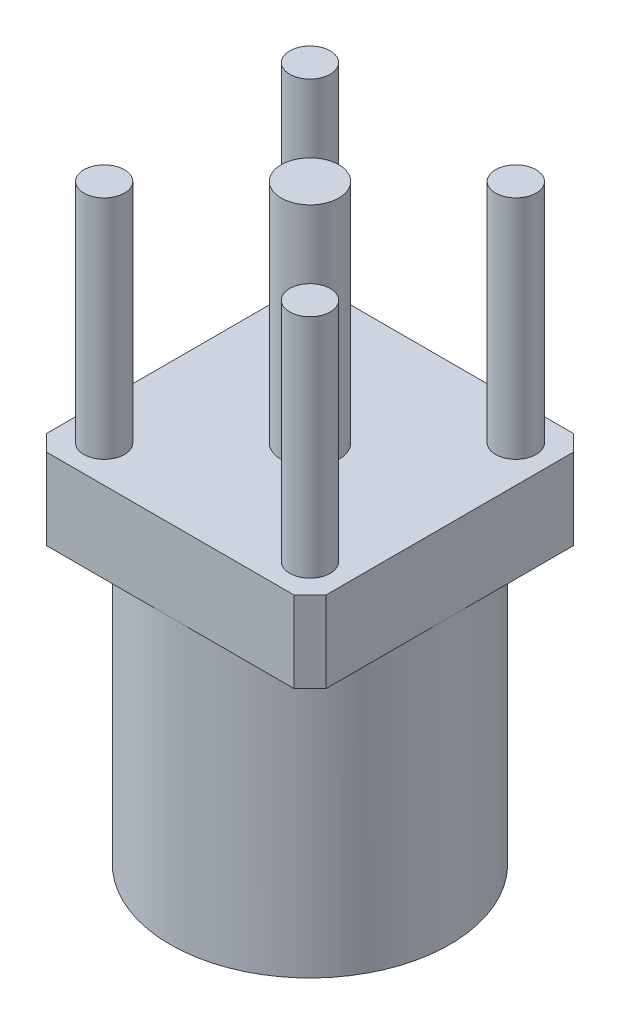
from build123d import *

# Parameters (mm, degrees)
BOSS_EXTRUDE1_DEPTH = 1
SKETCH4_R           = 1.725
SKETCH4_R_2         = 1.375
SKETCH4_R_3         = 0.35
BOSS_EXTRUDE2_DEPTH = 3.5
SKETCH5_R           = 0.25
SKETCH5_R_2         = 0.3556
BOSS_EXTRUDE3_DEPTH = 2.794
CUT_EXTRUDE1_START  = -1.016
SKETCH6_R           = 0.35
CUT_EXTRUDE1_DEPTH  = 1.016


with BuildPart() as part:
    # Sketch3 → Boss-Extrude1 (new body)
    with BuildSketch(Plane(origin=(0, 0, 0), x_dir=(1, 0, 0), z_dir=(0, 1, 0))):
        Polygon((-1.725, -1.525), (-1.525, -1.725), (1.525, -1.725), (1.725, -1.525), (1.725, 1.525), (1.525, 1.725), (-1.525, 1.725), (-1.725, 1.525), align=None)
    extrude(amount=BOSS_EXTRUDE1_DEPTH)

    # Sketch4 → Boss-Extrude2 (add)
    # profile 1 of 2: a face of its own
    with BuildSketch(Plane.XZ):
        with Locations(Location((0, 0, 0), (0, 0, 270))):
            Circle(SKETCH4_R)
        with Locations(Location((0, 0, 0), (0, 0, 270))):
            Circle(SKETCH4_R_2, mode=Mode.SUBTRACT)
    # profile 2 of 2: a face of its own
    with BuildSketch(Plane.XZ):
        with Locations(Location((0, 0, 0), (0, 0, 90))):
            Circle(SKETCH4_R_3)
    extrude(amount=BOSS_EXTRUDE2_DEPTH)

    # Sketch5 → Boss-Extrude3 (add)
    with BuildSketch(Plane(origin=(0, 1, 0), x_dir=(1, 0, 0), z_dir=(0, 1, 0))):
        with Locations(Location((-1.27, 1.27, 0), (0, 0, 270))):
            Circle(SKETCH5_R)
        with Locations(Location((-1.27, -1.27, 0), (0, 0, 270))):
            Circle(SKETCH5_R)
        with Locations(Location((1.27, 1.27, 0), (0, 0, 270))):
            Circle(SKETCH5_R)
        with Locations(Location((1.27, -1.27, 0), (0, 0, 270))):
            Circle(SKETCH5_R)
        with Locations(Location((0, 0, 0), (0, 0, 270))):
            Circle(SKETCH5_R_2)
    extrude(amount=BOSS_EXTRUDE3_DEPTH)

    # Sketch6 → Cut-Extrude1 (cut)
    with BuildSketch(Plane.XZ.offset(3.5).offset(CUT_EXTRUDE1_START)):
        with Locations(Location((0, 0, 0), (0, 0, 90))):
            Circle(SKETCH6_R)
    extrude(amount=CUT_EXTRUDE1_DEPTH, mode=Mode.SUBTRACT)


solid = part.part
